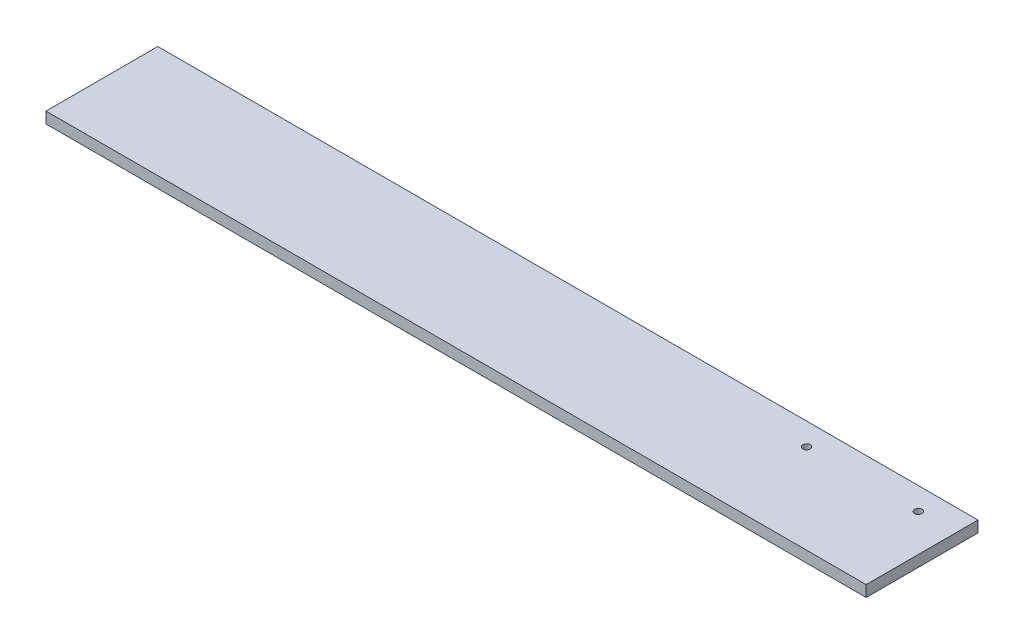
from build123d import *

# Parameters (mm, degrees)
SKETCH1_W           = 220
SKETCH1_H           = 30
BOSS_EXTRUDE1_DEPTH = 3
SKETCH2_R           = 1
CUT_EXTRUDE1_DEPTH  = 3


with BuildPart() as part:
    # Sketch1 → Boss-Extrude1 (new body)
    with BuildSketch(Plane(origin=(0, 0, 0), x_dir=(1, 0, 0), z_dir=(0, 1, 0))):
        Rectangle(SKETCH1_W, SKETCH1_H)
    extrude(amount=BOSS_EXTRUDE1_DEPTH)

    # Sketch2 → Cut-Extrude1 (cut)
    with BuildSketch(Plane(origin=(0, 3, 0), x_dir=(1, 0, 0), z_dir=(0, 1, 0))):
        with Locations(Location((100, 9, 0), (0, 0, 270))):
            Circle(SKETCH2_R)
        with Locations(Location((70, 9, 0), (0, 0, 270))):
            Circle(SKETCH2_R)
    extrude(amount=-CUT_EXTRUDE1_DEPTH, mode=Mode.SUBTRACT)


solid = part.part
